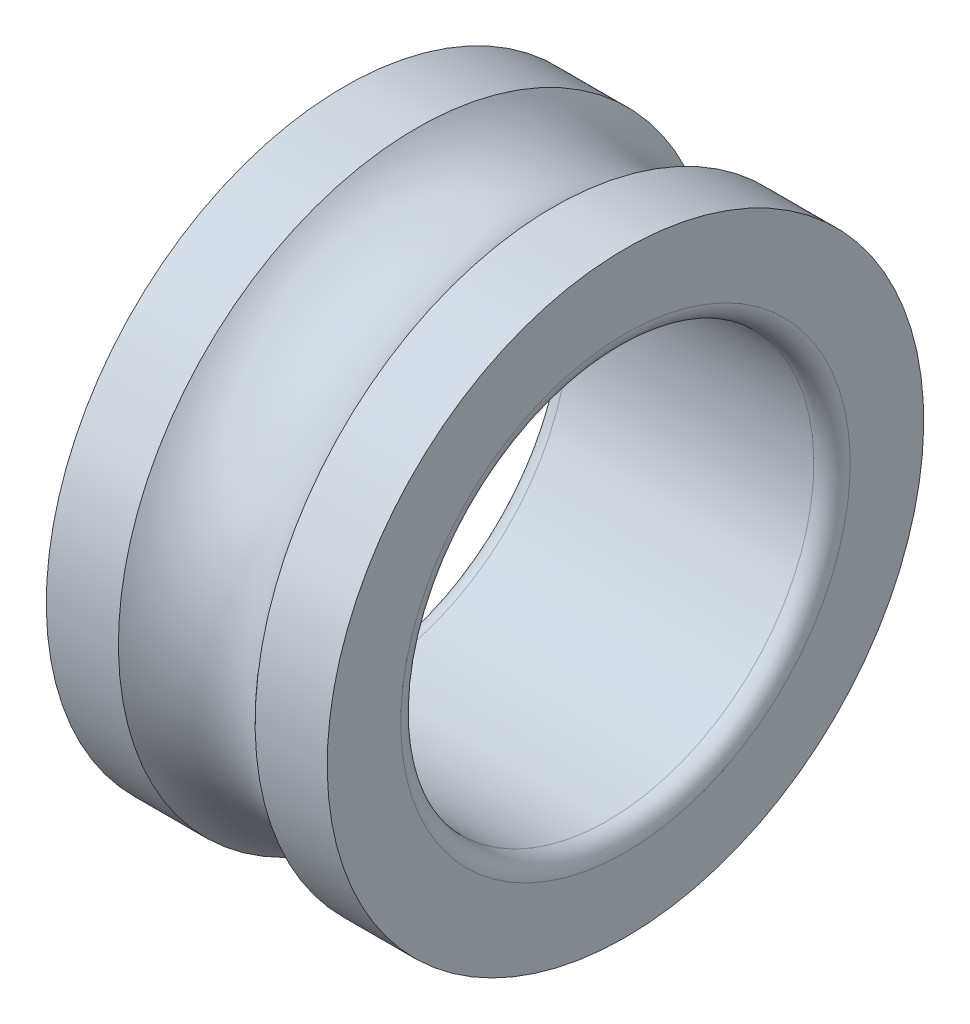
ISO-10303-21;
HEADER;
FILE_DESCRIPTION(('STEP AP214'),'2;1');
FILE_NAME('part.step','',(''),(''),'','','');
FILE_SCHEMA(('AUTOMOTIVE_DESIGN { 1 0 10303 214 1 1 1 1 }'));
ENDSEC;
DATA;
#1=APPLICATION_CONTEXT('core data for automotive mechanical design processes');
#2=APPLICATION_PROTOCOL_DEFINITION('international standard','automotive_design',2000,#1);
#3=PRODUCT_CONTEXT('',#1,'mechanical');
#4=PRODUCT('Part','Part','',(#3));
#5=PRODUCT_RELATED_PRODUCT_CATEGORY('part','',(#4));
#6=PRODUCT_DEFINITION_FORMATION('','',#4);
#7=PRODUCT_DEFINITION_CONTEXT('part definition',#1,'design');
#8=PRODUCT_DEFINITION('design','',#6,#7);
#9=PRODUCT_DEFINITION_SHAPE('','',#8);
#10=(LENGTH_UNIT() NAMED_UNIT(*) SI_UNIT(.MILLI.,.METRE.));
#11=(NAMED_UNIT(*) PLANE_ANGLE_UNIT() SI_UNIT($,.RADIAN.));
#12=(NAMED_UNIT(*) SI_UNIT($,.STERADIAN.) SOLID_ANGLE_UNIT());
#13=UNCERTAINTY_MEASURE_WITH_UNIT(LENGTH_MEASURE(1.E-05),#10,'distance_accuracy_value','');
#14=(GEOMETRIC_REPRESENTATION_CONTEXT(3) GLOBAL_UNCERTAINTY_ASSIGNED_CONTEXT((#13)) GLOBAL_UNIT_ASSIGNED_CONTEXT((#10,
#11,#12)) REPRESENTATION_CONTEXT('',''));
#15=CARTESIAN_POINT('',(0.,0.,0.));
#16=DIRECTION('',(0.,0.,1.));
#17=DIRECTION('',(1.,0.,0.));
#18=AXIS2_PLACEMENT_3D('',#15,#16,#17);
#19=CARTESIAN_POINT('',(1.09999999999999,0.,0.));
#20=DIRECTION('',(-1.,0.,0.));
#21=DIRECTION('',(0.,-1.,0.));
#22=AXIS2_PLACEMENT_3D('',#19,#20,#21);
#23=TOROIDAL_SURFACE('',#22,13.6,1.1);
#24=CARTESIAN_POINT('',(1.09999999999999,0.,0.));
#25=DIRECTION('',(-1.,0.,0.));
#26=DIRECTION('',(0.,-1.,0.));
#27=AXIS2_PLACEMENT_3D('',#24,#25,#26);
#28=CIRCLE('',#27,12.5);
#29=CARTESIAN_POINT('',(1.09999999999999,-12.5,0.));
#30=VERTEX_POINT('',#29);
#31=EDGE_CURVE('E10',#30,#30,#28,.T.);
#32=ORIENTED_EDGE('',*,*,#31,.F.);
#33=EDGE_LOOP('',(#32));
#34=FACE_BOUND('',#33,.T.);
#35=CARTESIAN_POINT('',(0.,0.,0.));
#36=DIRECTION('',(-1.,0.,0.));
#37=DIRECTION('',(0.,-1.,0.));
#38=AXIS2_PLACEMENT_3D('',#35,#36,#37);
#39=CIRCLE('',#38,13.6);
#40=CARTESIAN_POINT('',(0.,-13.6,0.));
#41=VERTEX_POINT('',#40);
#42=EDGE_CURVE('E58',#41,#41,#39,.T.);
#43=ORIENTED_EDGE('',*,*,#42,.T.);
#44=EDGE_LOOP('',(#43));
#45=FACE_BOUND('',#44,.T.);
#46=ADVANCED_FACE('F30',(#34,#45),#23,.T.);
#47=CARTESIAN_POINT('',(0.,0.,0.));
#48=DIRECTION('',(-1.,0.,0.));
#49=DIRECTION('',(0.,-1.,0.));
#50=AXIS2_PLACEMENT_3D('',#47,#48,#49);
#51=CYLINDRICAL_SURFACE('',#50,12.5);
#52=CARTESIAN_POINT('',(15.9,0.,0.));
#53=DIRECTION('',(-1.,0.,0.));
#54=DIRECTION('',(0.,-1.,0.));
#55=AXIS2_PLACEMENT_3D('',#52,#53,#54);
#56=CIRCLE('',#55,12.5);
#57=CARTESIAN_POINT('',(15.9,-12.5,0.));
#58=VERTEX_POINT('',#57);
#59=EDGE_CURVE('E36',#58,#58,#56,.T.);
#60=ORIENTED_EDGE('',*,*,#59,.F.);
#61=EDGE_LOOP('',(#60));
#62=FACE_BOUND('',#61,.T.);
#63=ORIENTED_EDGE('',*,*,#31,.T.);
#64=EDGE_LOOP('',(#63));
#65=FACE_BOUND('',#64,.T.);
#66=ADVANCED_FACE('F95',(#62,#65),#51,.F.);
#67=CARTESIAN_POINT('',(15.9,0.,0.));
#68=DIRECTION('',(-1.,0.,0.));
#69=DIRECTION('',(0.,-1.,0.));
#70=AXIS2_PLACEMENT_3D('',#67,#68,#69);
#71=TOROIDAL_SURFACE('',#70,13.6,1.1);
#72=CARTESIAN_POINT('',(17.,0.,0.));
#73=DIRECTION('',(-1.,0.,0.));
#74=DIRECTION('',(0.,-1.,0.));
#75=AXIS2_PLACEMENT_3D('',#72,#73,#74);
#76=CIRCLE('',#75,13.6);
#77=CARTESIAN_POINT('',(17.,-13.6,0.));
#78=VERTEX_POINT('',#77);
#79=EDGE_CURVE('E40',#78,#78,#76,.T.);
#80=ORIENTED_EDGE('',*,*,#79,.F.);
#81=EDGE_LOOP('',(#80));
#82=FACE_BOUND('',#81,.T.);
#83=ORIENTED_EDGE('',*,*,#59,.T.);
#84=EDGE_LOOP('',(#83));
#85=FACE_BOUND('',#84,.T.);
#86=ADVANCED_FACE('F90',(#82,#85),#71,.T.);
#87=CARTESIAN_POINT('',(17.,18.05,0.));
#88=DIRECTION('',(-1.,0.,0.));
#89=DIRECTION('',(0.,-1.,0.));
#90=AXIS2_PLACEMENT_3D('',#87,#88,#89);
#91=PLANE('',#90);
#92=CARTESIAN_POINT('',(17.,0.,0.));
#93=DIRECTION('',(-1.,0.,0.));
#94=DIRECTION('',(0.,-1.,0.));
#95=AXIS2_PLACEMENT_3D('',#92,#93,#94);
#96=CIRCLE('',#95,18.05);
#97=CARTESIAN_POINT('',(17.,-18.05,0.));
#98=VERTEX_POINT('',#97);
#99=EDGE_CURVE('E44',#98,#98,#96,.T.);
#100=ORIENTED_EDGE('',*,*,#99,.F.);
#101=EDGE_LOOP('',(#100));
#102=FACE_BOUND('',#101,.T.);
#103=ORIENTED_EDGE('',*,*,#79,.T.);
#104=EDGE_LOOP('',(#103));
#105=FACE_BOUND('',#104,.T.);
#106=ADVANCED_FACE('F84',(#102,#105),#91,.F.);
#107=CARTESIAN_POINT('',(0.,0.,0.));
#108=DIRECTION('',(-1.,0.,0.));
#109=DIRECTION('',(0.,-1.,0.));
#110=AXIS2_PLACEMENT_3D('',#107,#108,#109);
#111=CYLINDRICAL_SURFACE('',#110,18.05);
#112=CARTESIAN_POINT('',(12.6367257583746,0.,0.));
#113=DIRECTION('',(-1.,0.,0.));
#114=DIRECTION('',(0.,-1.,0.));
#115=AXIS2_PLACEMENT_3D('',#112,#113,#114);
#116=CIRCLE('',#115,18.05);
#117=CARTESIAN_POINT('',(12.6367257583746,-18.05,0.));
#118=VERTEX_POINT('',#117);
#119=EDGE_CURVE('E49',#118,#118,#116,.T.);
#120=ORIENTED_EDGE('',*,*,#119,.F.);
#121=EDGE_LOOP('',(#120));
#122=FACE_BOUND('',#121,.T.);
#123=ORIENTED_EDGE('',*,*,#99,.T.);
#124=EDGE_LOOP('',(#123));
#125=FACE_BOUND('',#124,.T.);
#126=ADVANCED_FACE('F78',(#122,#125),#111,.T.);
#127=CARTESIAN_POINT('',(8.49999999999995,0.,0.));
#128=DIRECTION('',(-1.,0.,0.));
#129=DIRECTION('',(0.,-1.,0.));
#130=AXIS2_PLACEMENT_3D('',#127,#128,#129);
#131=TOROIDAL_SURFACE('',#130,21.75,5.55);
#132=CARTESIAN_POINT('',(4.36327424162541,0.,0.));
#133=DIRECTION('',(-1.,0.,0.));
#134=DIRECTION('',(0.,-1.,0.));
#135=AXIS2_PLACEMENT_3D('',#132,#133,#134);
#136=CIRCLE('',#135,18.05);
#137=CARTESIAN_POINT('',(4.36327424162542,-18.05,0.));
#138=VERTEX_POINT('',#137);
#139=EDGE_CURVE('E52',#138,#138,#136,.T.);
#140=ORIENTED_EDGE('',*,*,#139,.F.);
#141=EDGE_LOOP('',(#140));
#142=FACE_BOUND('',#141,.T.);
#143=ORIENTED_EDGE('',*,*,#119,.T.);
#144=EDGE_LOOP('',(#143));
#145=FACE_BOUND('',#144,.T.);
#146=ADVANCED_FACE('F72',(#142,#145),#131,.F.);
#147=CARTESIAN_POINT('',(0.,0.,0.));
#148=DIRECTION('',(-1.,0.,0.));
#149=DIRECTION('',(0.,-1.,0.));
#150=AXIS2_PLACEMENT_3D('',#147,#148,#149);
#151=CYLINDRICAL_SURFACE('',#150,18.05);
#152=CARTESIAN_POINT('',(0.,0.,0.));
#153=DIRECTION('',(-1.,0.,0.));
#154=DIRECTION('',(0.,-1.,0.));
#155=AXIS2_PLACEMENT_3D('',#152,#153,#154);
#156=CIRCLE('',#155,18.05);
#157=CARTESIAN_POINT('',(0.,-18.05,0.));
#158=VERTEX_POINT('',#157);
#159=EDGE_CURVE('E55',#158,#158,#156,.T.);
#160=ORIENTED_EDGE('',*,*,#159,.F.);
#161=EDGE_LOOP('',(#160));
#162=FACE_BOUND('',#161,.T.);
#163=ORIENTED_EDGE('',*,*,#139,.T.);
#164=EDGE_LOOP('',(#163));
#165=FACE_BOUND('',#164,.T.);
#166=ADVANCED_FACE('F66',(#162,#165),#151,.T.);
#167=CARTESIAN_POINT('',(0.,18.05,0.));
#168=DIRECTION('',(1.,0.,0.));
#169=DIRECTION('',(0.,1.,0.));
#170=AXIS2_PLACEMENT_3D('',#167,#168,#169);
#171=PLANE('',#170);
#172=ORIENTED_EDGE('',*,*,#42,.F.);
#173=EDGE_LOOP('',(#172));
#174=FACE_BOUND('',#173,.T.);
#175=ORIENTED_EDGE('',*,*,#159,.T.);
#176=EDGE_LOOP('',(#175));
#177=FACE_BOUND('',#176,.T.);
#178=ADVANCED_FACE('F63',(#174,#177),#171,.F.);
#179=CLOSED_SHELL('',(#46,#66,#86,#106,#126,#146,#166,#178));
#180=MANIFOLD_SOLID_BREP('B2',#179);
#181=ADVANCED_BREP_SHAPE_REPRESENTATION('',(#18,#180),#14);
#182=SHAPE_DEFINITION_REPRESENTATION(#9,#181);
ENDSEC;
END-ISO-10303-21;
